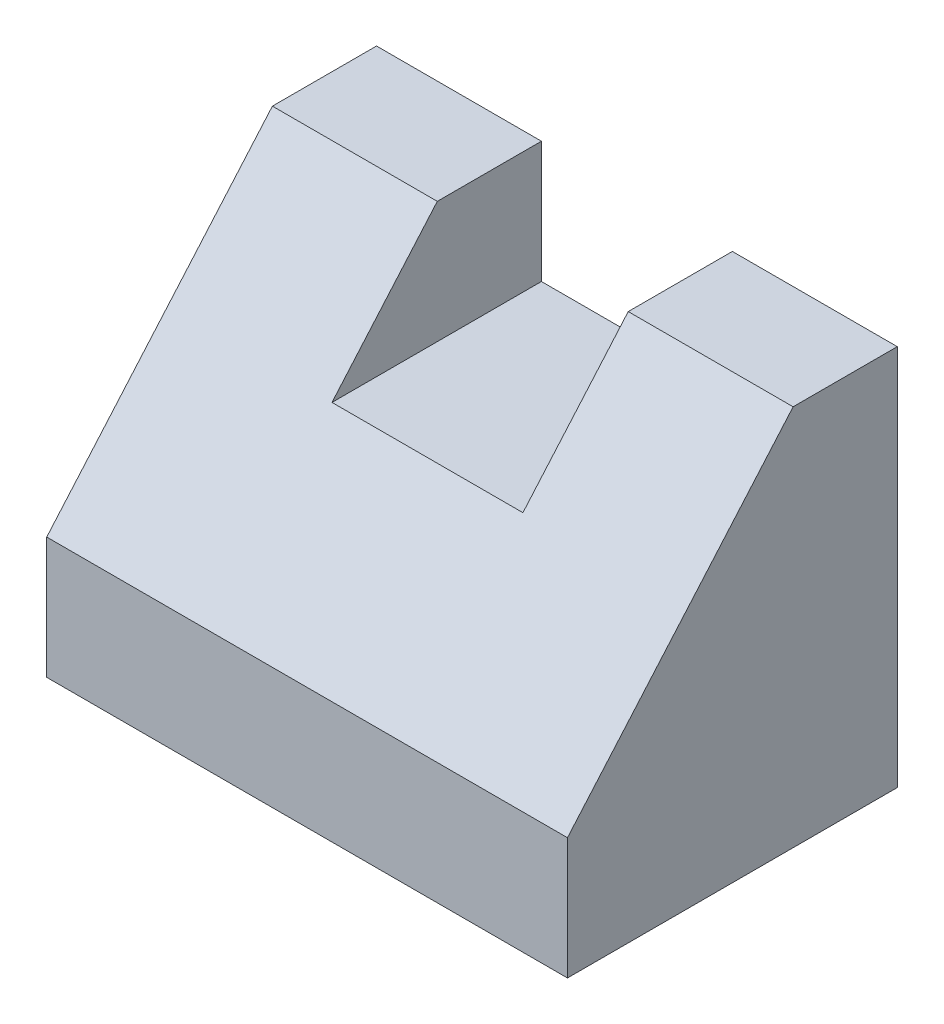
from build123d import *

# Parameters (mm, degrees)
EXTRUDE_1_DEPTH     = 15
SKETCH_2_W          = 11
SKETCH_2_H          = 9.266283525
CUT_EXTRUDE_1_DEPTH = 30


with BuildPart() as part:
    # Sketch 1 → Extrude 1 (new, symmetric)
    with BuildSketch(Plane(origin=(0, 0, 0), x_dir=(0, 0, -1), z_dir=(1, 0, 0))):
        Polygon((0, 0), (0, -22), (-19, -22), (-19, -15), (-6, 0), align=None)
    extrude(amount=EXTRUDE_1_DEPTH, both=True)

    # Sketch 2 → Cut-Extrude 1 (cut)
    with BuildSketch(Plane(origin=(0, 0, 0), x_dir=(-1, 0, 0), z_dir=(0, 0, -1))):
        with Locations((0, -2.366858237)):
            Rectangle(SKETCH_2_W, SKETCH_2_H)
    extrude(amount=-CUT_EXTRUDE_1_DEPTH, mode=Mode.SUBTRACT)


solid = part.part
